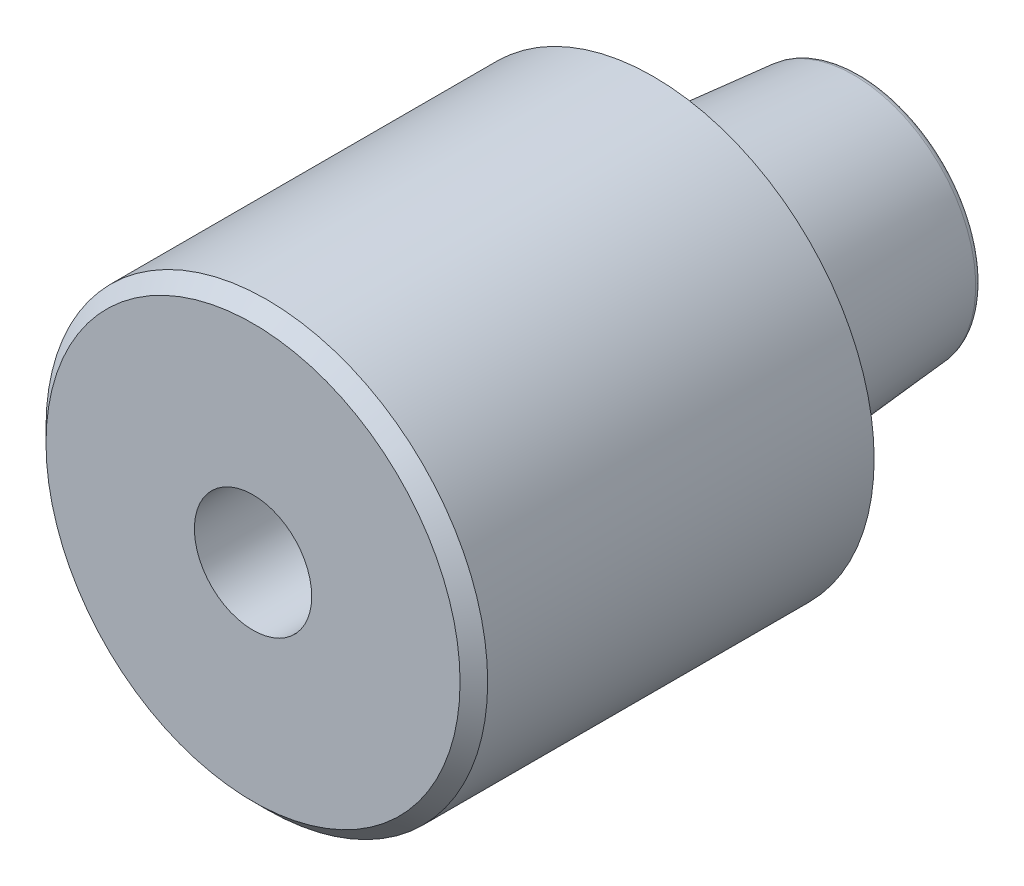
ISO-10303-21;
HEADER;
FILE_DESCRIPTION(('STEP AP214'),'2;1');
FILE_NAME('part.step','',(''),(''),'','','');
FILE_SCHEMA(('AUTOMOTIVE_DESIGN { 1 0 10303 214 1 1 1 1 }'));
ENDSEC;
DATA;
#1=APPLICATION_CONTEXT('core data for automotive mechanical design processes');
#2=APPLICATION_PROTOCOL_DEFINITION('international standard','automotive_design',2000,#1);
#3=PRODUCT_CONTEXT('',#1,'mechanical');
#4=PRODUCT('Part','Part','',(#3));
#5=PRODUCT_RELATED_PRODUCT_CATEGORY('part','',(#4));
#6=PRODUCT_DEFINITION_FORMATION('','',#4);
#7=PRODUCT_DEFINITION_CONTEXT('part definition',#1,'design');
#8=PRODUCT_DEFINITION('design','',#6,#7);
#9=PRODUCT_DEFINITION_SHAPE('','',#8);
#10=(LENGTH_UNIT() NAMED_UNIT(*) SI_UNIT(.MILLI.,.METRE.));
#11=(NAMED_UNIT(*) PLANE_ANGLE_UNIT() SI_UNIT($,.RADIAN.));
#12=(NAMED_UNIT(*) SI_UNIT($,.STERADIAN.) SOLID_ANGLE_UNIT());
#13=UNCERTAINTY_MEASURE_WITH_UNIT(LENGTH_MEASURE(1.E-05),#10,'distance_accuracy_value','');
#14=(GEOMETRIC_REPRESENTATION_CONTEXT(3) GLOBAL_UNCERTAINTY_ASSIGNED_CONTEXT((#13)) GLOBAL_UNIT_ASSIGNED_CONTEXT((#10,
#11,#12)) REPRESENTATION_CONTEXT('',''));
#15=CARTESIAN_POINT('',(0.,0.,0.));
#16=DIRECTION('',(0.,0.,1.));
#17=DIRECTION('',(1.,0.,0.));
#18=AXIS2_PLACEMENT_3D('',#15,#16,#17);
#19=CARTESIAN_POINT('',(1.56226912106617E-13,0.,22.3725830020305));
#20=DIRECTION('',(0.,0.,-1.));
#21=DIRECTION('',(1.,0.,0.));
#22=AXIS2_PLACEMENT_3D('',#19,#20,#21);
#23=CONICAL_SURFACE('',#22,22.6274169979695,0.785398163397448);
#24=CARTESIAN_POINT('',(2.09488880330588E-13,0.,30.));
#25=DIRECTION('',(0.,0.,-1.));
#26=DIRECTION('',(-1.,0.,0.));
#27=AXIS2_PLACEMENT_3D('',#24,#25,#26);
#28=CIRCLE('',#27,15.);
#29=CARTESIAN_POINT('',(-14.9999999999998,0.,30.));
#30=VERTEX_POINT('',#29);
#31=CARTESIAN_POINT('',(15.,0.,30.));
#32=VERTEX_POINT('',#31);
#33=EDGE_CURVE('E59',#30,#32,#28,.T.);
#34=ORIENTED_EDGE('',*,*,#33,.T.);
#35=CARTESIAN_POINT('',(15.0000010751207,0.,29.9999989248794));
#36=CARTESIAN_POINT('',(16.0000024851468,0.,28.9999975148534));
#37=B_SPLINE_CURVE_WITH_KNOTS('',1,(#35,#36),.UNSPECIFIED.,.F.,.F.,(2,2),(0.662912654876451,
0.707106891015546),.UNSPECIFIED.);
#38=CARTESIAN_POINT('',(16.,0.,29.));
#39=VERTEX_POINT('',#38);
#40=EDGE_CURVE('E46',#32,#39,#37,.T.);
#41=ORIENTED_EDGE('',*,*,#40,.T.);
#42=CARTESIAN_POINT('',(2.02505917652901E-13,0.,29.));
#43=DIRECTION('',(0.,0.,1.));
#44=DIRECTION('',(-1.,0.,0.));
#45=AXIS2_PLACEMENT_3D('',#42,#43,#44);
#46=CIRCLE('',#45,16.);
#47=CARTESIAN_POINT('',(-16.,0.,29.));
#48=VERTEX_POINT('',#47);
#49=EDGE_CURVE('E97',#39,#48,#46,.T.);
#50=ORIENTED_EDGE('',*,*,#49,.T.);
#51=CARTESIAN_POINT('',(2.02505917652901E-13,0.,29.));
#52=DIRECTION('',(0.,0.,1.));
#53=DIRECTION('',(-1.,0.,0.));
#54=AXIS2_PLACEMENT_3D('',#51,#52,#53);
#55=CIRCLE('',#54,16.);
#56=EDGE_CURVE('E11',#48,#39,#55,.T.);
#57=ORIENTED_EDGE('',*,*,#56,.T.);
#58=ORIENTED_EDGE('',*,*,#40,.F.);
#59=CARTESIAN_POINT('',(2.09488880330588E-13,0.,30.));
#60=DIRECTION('',(0.,0.,-1.));
#61=DIRECTION('',(-1.,0.,0.));
#62=AXIS2_PLACEMENT_3D('',#59,#60,#61);
#63=CIRCLE('',#62,15.);
#64=EDGE_CURVE('E94',#32,#30,#63,.T.);
#65=ORIENTED_EDGE('',*,*,#64,.T.);
#66=EDGE_LOOP('',(#34,#41,#50,#57,#58,#65));
#67=FACE_BOUND('',#66,.T.);
#68=ADVANCED_FACE('F38',(#67),#23,.T.);
#69=CARTESIAN_POINT('',(1.08235921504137E-13,0.,15.5));
#70=DIRECTION('',(0.,0.,-1.));
#71=DIRECTION('',(-1.,0.,0.));
#72=AXIS2_PLACEMENT_3D('',#69,#70,#71);
#73=CYLINDRICAL_SURFACE('',#72,16.);
#74=ORIENTED_EDGE('',*,*,#49,.F.);
#75=ORIENTED_EDGE('',*,*,#56,.F.);
#76=CARTESIAN_POINT('',(-16.,0.,29.0000010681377));
#77=CARTESIAN_POINT('',(-16.,0.,1.00000036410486));
#78=B_SPLINE_CURVE_WITH_KNOTS('',1,(#76,#77),.UNSPECIFIED.,.F.,.F.,(2,2),(0.0833333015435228,
0.916666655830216),.UNSPECIFIED.);
#79=CARTESIAN_POINT('',(-16.,0.,1.00000000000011));
#80=VERTEX_POINT('',#79);
#81=EDGE_CURVE('E132',#48,#80,#78,.T.);
#82=ORIENTED_EDGE('',*,*,#81,.T.);
#83=CARTESIAN_POINT('',(0.,0.,1.));
#84=DIRECTION('',(0.,0.,-1.));
#85=DIRECTION('',(-1.,0.,0.));
#86=AXIS2_PLACEMENT_3D('',#83,#84,#85);
#87=CIRCLE('',#86,16.);
#88=EDGE_CURVE('E137',#80,#80,#87,.T.);
#89=ORIENTED_EDGE('',*,*,#88,.F.);
#90=ORIENTED_EDGE('',*,*,#81,.F.);
#91=EDGE_LOOP('',(#74,#75,#82,#89,#90));
#92=FACE_BOUND('',#91,.T.);
#93=ADVANCED_FACE('F182',(#92),#73,.T.);
#94=CARTESIAN_POINT('',(-19.5,-31.1769145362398,30.));
#95=DIRECTION('',(0.,0.,1.));
#96=DIRECTION('',(1.,0.,0.));
#97=AXIS2_PLACEMENT_3D('',#94,#95,#96);
#98=PLANE('',#97);
#99=CARTESIAN_POINT('',(0.,0.,29.9999999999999));
#100=DIRECTION('',(0.,0.,1.));
#101=DIRECTION('',(1.,0.,0.));
#102=AXIS2_PLACEMENT_3D('',#99,#100,#101);
#103=CIRCLE('',#102,4.24999999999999);
#104=CARTESIAN_POINT('',(4.24999999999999,0.,29.9999999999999));
#105=VERTEX_POINT('',#104);
#106=EDGE_CURVE('E95',#105,#105,#103,.T.);
#107=ORIENTED_EDGE('',*,*,#106,.F.);
#108=EDGE_LOOP('',(#107));
#109=FACE_BOUND('',#108,.T.);
#110=ORIENTED_EDGE('',*,*,#64,.F.);
#111=ORIENTED_EDGE('',*,*,#33,.F.);
#112=EDGE_LOOP('',(#110,#111));
#113=FACE_BOUND('',#112,.T.);
#114=ADVANCED_FACE('F185',(#109,#113),#98,.T.);
#115=CARTESIAN_POINT('',(0.,0.,-13.5));
#116=DIRECTION('',(0.,0.,-1.));
#117=DIRECTION('',(-1.,0.,0.));
#118=AXIS2_PLACEMENT_3D('',#115,#116,#117);
#119=TOROIDAL_SURFACE('',#118,8.31699312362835,0.5);
#120=CARTESIAN_POINT('',(0.,0.,-13.5435778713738));
#121=DIRECTION('',(0.,0.,-1.));
#122=DIRECTION('',(-1.,0.,0.));
#123=AXIS2_PLACEMENT_3D('',#120,#121,#122);
#124=CIRCLE('',#123,8.81509047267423);
#125=CARTESIAN_POINT('',(-8.81509047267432,0.,-13.5435778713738));
#126=VERTEX_POINT('',#125);
#127=EDGE_CURVE('E138',#126,#126,#124,.T.);
#128=ORIENTED_EDGE('',*,*,#127,.T.);
#129=CARTESIAN_POINT('',(-8.81509047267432,0.,-13.5435778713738));
#130=CARTESIAN_POINT('',(-8.77515871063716,0.,-13.9999999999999));
#131=CARTESIAN_POINT('',(-8.31699312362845,0.,-14.));
#132=(BOUNDED_CURVE() B_SPLINE_CURVE(2,(#129,#130,#131),.UNSPECIFIED.,.F.,
.F.) B_SPLINE_CURVE_WITH_KNOTS((3,3),(0.,0.5),
.UNSPECIFIED.) CURVE() GEOMETRIC_REPRESENTATION_ITEM() RATIONAL_B_SPLINE_CURVE((1.,
0.737277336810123,1.)) REPRESENTATION_ITEM(''));
#133=CARTESIAN_POINT('',(-8.31699312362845,0.,-14.));
#134=VERTEX_POINT('',#133);
#135=EDGE_CURVE('E121',#126,#134,#132,.T.);
#136=ORIENTED_EDGE('',*,*,#135,.T.);
#137=CARTESIAN_POINT('',(0.,0.,-14.));
#138=DIRECTION('',(0.,0.,1.));
#139=DIRECTION('',(-1.,0.,0.));
#140=AXIS2_PLACEMENT_3D('',#137,#138,#139);
#141=CIRCLE('',#140,8.31699312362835);
#142=EDGE_CURVE('E127',#134,#134,#141,.T.);
#143=ORIENTED_EDGE('',*,*,#142,.T.);
#144=ORIENTED_EDGE('',*,*,#135,.F.);
#145=EDGE_LOOP('',(#128,#136,#143,#144));
#146=FACE_BOUND('',#145,.T.);
#147=ADVANCED_FACE('F187',(#146),#119,.T.);
#148=CARTESIAN_POINT('',(0.,0.,0.));
#149=DIRECTION('',(0.,0.,1.));
#150=DIRECTION('',(-1.,0.,0.));
#151=AXIS2_PLACEMENT_3D('',#148,#149,#150);
#152=CONICAL_SURFACE('',#151,10.,0.0872664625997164);
#153=ORIENTED_EDGE('',*,*,#127,.F.);
#154=CARTESIAN_POINT('',(-8.81509047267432,0.,-13.5435778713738));
#155=CARTESIAN_POINT('',(-10.,0.,0.));
#156=B_SPLINE_CURVE_WITH_KNOTS('',1,(#154,#155),.UNSPECIFIED.,.F.,.F.,(2,2),(0.,1.),.UNSPECIFIED.);
#157=CARTESIAN_POINT('',(-10.,0.,0.));
#158=VERTEX_POINT('',#157);
#159=EDGE_CURVE('E110',#126,#158,#156,.T.);
#160=ORIENTED_EDGE('',*,*,#159,.T.);
#161=CARTESIAN_POINT('',(0.,0.,0.));
#162=DIRECTION('',(0.,0.,-1.));
#163=DIRECTION('',(-1.,0.,0.));
#164=AXIS2_PLACEMENT_3D('',#161,#162,#163);
#165=CIRCLE('',#164,10.);
#166=EDGE_CURVE('E116',#158,#158,#165,.T.);
#167=ORIENTED_EDGE('',*,*,#166,.T.);
#168=ORIENTED_EDGE('',*,*,#159,.F.);
#169=EDGE_LOOP('',(#153,#160,#167,#168));
#170=FACE_BOUND('',#169,.T.);
#171=ADVANCED_FACE('F194',(#170),#152,.T.);
#172=CARTESIAN_POINT('',(19.1290841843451,-17.2865455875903,-14.0000000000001));
#173=DIRECTION('',(0.,0.,-1.));
#174=DIRECTION('',(-1.,0.,0.));
#175=AXIS2_PLACEMENT_3D('',#172,#173,#174);
#176=PLANE('',#175);
#177=ORIENTED_EDGE('',*,*,#142,.F.);
#178=EDGE_LOOP('',(#177));
#179=FACE_BOUND('',#178,.T.);
#180=ADVANCED_FACE('F222',(#179),#176,.T.);
#181=CARTESIAN_POINT('',(0.,0.,0.5));
#182=DIRECTION('',(0.,0.,-1.));
#183=DIRECTION('',(-1.,0.,0.));
#184=AXIS2_PLACEMENT_3D('',#181,#182,#183);
#185=CYLINDRICAL_SURFACE('',#184,10.);
#186=CARTESIAN_POINT('',(0.,0.,1.));
#187=DIRECTION('',(0.,0.,1.));
#188=DIRECTION('',(-1.,0.,0.));
#189=AXIS2_PLACEMENT_3D('',#186,#187,#188);
#190=CIRCLE('',#189,10.);
#191=CARTESIAN_POINT('',(-10.,0.,1.00000000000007));
#192=VERTEX_POINT('',#191);
#193=EDGE_CURVE('E105',#192,#192,#190,.T.);
#194=ORIENTED_EDGE('',*,*,#193,.F.);
#195=CARTESIAN_POINT('',(-10.,0.,1.00000305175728));
#196=CARTESIAN_POINT('',(-10.,0.,5.31746945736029E-07));
#197=B_SPLINE_CURVE_WITH_KNOTS('',1,(#195,#196),.UNSPECIFIED.,.F.,.F.,(2,2),(0.0833307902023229,
0.91666622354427),.UNSPECIFIED.);
#198=EDGE_CURVE('E102',#192,#158,#197,.T.);
#199=ORIENTED_EDGE('',*,*,#198,.T.);
#200=ORIENTED_EDGE('',*,*,#166,.F.);
#201=ORIENTED_EDGE('',*,*,#198,.F.);
#202=EDGE_LOOP('',(#194,#199,#200,#201));
#203=FACE_BOUND('',#202,.T.);
#204=ADVANCED_FACE('F231',(#203),#185,.T.);
#205=CARTESIAN_POINT('',(36.8,-33.2553755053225,0.999999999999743));
#206=DIRECTION('',(0.,0.,-1.));
#207=DIRECTION('',(-1.,0.,0.));
#208=AXIS2_PLACEMENT_3D('',#205,#206,#207);
#209=PLANE('',#208);
#210=ORIENTED_EDGE('',*,*,#88,.T.);
#211=EDGE_LOOP('',(#210));
#212=FACE_BOUND('',#211,.T.);
#213=ORIENTED_EDGE('',*,*,#193,.T.);
#214=EDGE_LOOP('',(#213));
#215=FACE_BOUND('',#214,.T.);
#216=ADVANCED_FACE('F88',(#212,#215),#209,.T.);
#217=CARTESIAN_POINT('',(0.,0.,7.99999999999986));
#218=DIRECTION('',(0.,0.,1.));
#219=DIRECTION('',(1.,0.,0.));
#220=AXIS2_PLACEMENT_3D('',#217,#218,#219);
#221=CONICAL_SURFACE('',#220,4.24999999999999,1.02974425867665);
#222=CARTESIAN_POINT('',(0.,0.,5.44634236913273));
#223=VERTEX_POINT('',#222);
#224=VERTEX_LOOP('',#223);
#225=FACE_BOUND('',#224,.T.);
#226=CARTESIAN_POINT('',(0.,0.,7.99999999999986));
#227=DIRECTION('',(0.,0.,1.));
#228=DIRECTION('',(1.,0.,0.));
#229=AXIS2_PLACEMENT_3D('',#226,#227,#228);
#230=CIRCLE('',#229,4.24999999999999);
#231=CARTESIAN_POINT('',(4.24999999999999,0.,7.99999999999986));
#232=VERTEX_POINT('',#231);
#233=EDGE_CURVE('E92',#232,#232,#230,.T.);
#234=ORIENTED_EDGE('',*,*,#233,.T.);
#235=EDGE_LOOP('',(#234));
#236=FACE_BOUND('',#235,.T.);
#237=ADVANCED_FACE('F84',(#225,#236),#221,.F.);
#238=CARTESIAN_POINT('',(0.,0.,29.9999999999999));
#239=DIRECTION('',(0.,0.,1.));
#240=DIRECTION('',(1.,0.,0.));
#241=AXIS2_PLACEMENT_3D('',#238,#239,#240);
#242=CYLINDRICAL_SURFACE('',#241,4.24999999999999);
#243=ORIENTED_EDGE('',*,*,#233,.F.);
#244=EDGE_LOOP('',(#243));
#245=FACE_BOUND('',#244,.T.);
#246=ORIENTED_EDGE('',*,*,#106,.T.);
#247=EDGE_LOOP('',(#246));
#248=FACE_BOUND('',#247,.T.);
#249=ADVANCED_FACE('F87',(#245,#248),#242,.F.);
#250=CLOSED_SHELL('',(#68,#93,#114,#147,#171,#180,#204,#216,#237,#249));
#251=MANIFOLD_SOLID_BREP('B2',#250);
#252=ADVANCED_BREP_SHAPE_REPRESENTATION('',(#18,#251),#14);
#253=SHAPE_DEFINITION_REPRESENTATION(#9,#252);
ENDSEC;
END-ISO-10303-21;
